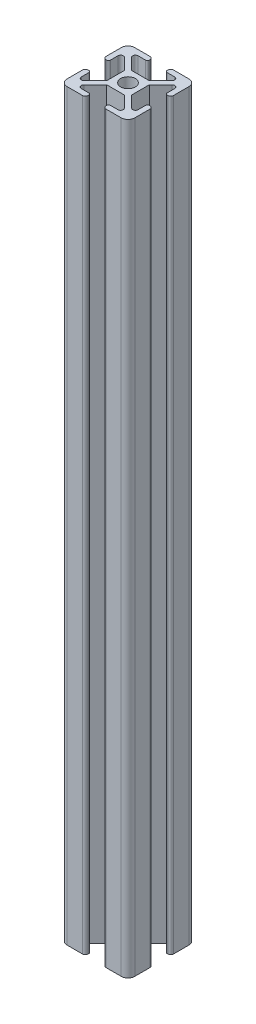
from build123d import *

# Parameters (mm, degrees)
CROQUIS1_R              = 2.175
SALIENTE_EXTRUIR1_DEPTH = 220


with BuildPart() as part:
    # Croquis1 → Saliente-Extruir1 (new body)
    with BuildSketch(Plane(origin=(0, 0, 0), x_dir=(1, 0, 0), z_dir=(0, 1, 0))):
        with BuildLine():
            Line((-2.614339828, 3.675), (2.614339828, 3.675))
            Line((2.614339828, 3.675), (5.973654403, 7.034314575))
            ThreePointArc((5.973654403, 7.034314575), (6.147072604, 7.906146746), (5.407968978, 8.4))
            Line((5.407968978, 8.4), (3.15, 8.4))
            ThreePointArc((3.15, 8.4), (2.796446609, 8.546446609), (2.65, 8.9))
            Line((2.65, 8.9), (2.65, 9.2))
            ThreePointArc((2.65, 9.2), (2.884314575, 9.765685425), (3.45, 10))
            Line((3.45, 10), (8, 10))
            ThreePointArc((8, 10), (9.414213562, 9.414213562), (10, 8))
            Line((10, 8), (10, 3.45))
            ThreePointArc((10, 3.45), (9.765685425, 2.884314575), (9.2, 2.65))
            Line((9.2, 2.65), (8.9, 2.65))
            ThreePointArc((8.9, 2.65), (8.546446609, 2.796446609), (8.4, 3.15))
            Line((8.4, 3.15), (8.4, 5.407968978))
            ThreePointArc((8.4, 5.407968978), (7.906146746, 6.147072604), (7.034314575, 5.973654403))
            Line((7.034314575, 5.973654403), (3.675, 2.614339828))
            Line((3.675, 2.614339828), (3.675, -2.614339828))
            Line((3.675, -2.614339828), (7.034314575, -5.973654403))
            ThreePointArc((7.034314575, -5.973654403), (7.906146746, -6.147072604), (8.4, -5.407968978))
            Line((8.4, -5.407968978), (8.4, -3.15))
            ThreePointArc((8.4, -3.15), (8.546446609, -2.796446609), (8.9, -2.65))
            Line((8.9, -2.65), (9.2, -2.65))
            ThreePointArc((9.2, -2.65), (9.765685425, -2.884314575), (10, -3.45))
            Line((10, -3.45), (10, -8))
            ThreePointArc((10, -8), (9.414213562, -9.414213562), (8, -10))
            Line((8, -10), (3.45, -10))
            ThreePointArc((3.45, -10), (2.884314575, -9.765685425), (2.65, -9.2))
            Line((2.65, -9.2), (2.65, -8.9))
            ThreePointArc((2.65, -8.9), (2.796446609, -8.546446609), (3.15, -8.4))
            Line((3.15, -8.4), (5.407968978, -8.4))
            ThreePointArc((5.407968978, -8.4), (6.147072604, -7.906146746), (5.973654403, -7.034314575))
            Line((5.973654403, -7.034314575), (2.614339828, -3.675))
            Line((2.614339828, -3.675), (-2.614339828, -3.675))
            Line((-2.614339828, -3.675), (-5.973654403, -7.034314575))
            ThreePointArc((-5.973654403, -7.034314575), (-6.147072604, -7.906146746), (-5.407968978, -8.4))
            Line((-5.407968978, -8.4), (-3.15, -8.4))
            ThreePointArc((-3.15, -8.4), (-2.796446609, -8.546446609), (-2.65, -8.9))
            Line((-2.65, -8.9), (-2.65, -9.2))
            ThreePointArc((-2.65, -9.2), (-2.884314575, -9.765685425), (-3.45, -10))
            Line((-3.45, -10), (-8, -10))
            ThreePointArc((-8, -10), (-9.414213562, -9.414213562), (-10, -8))
            Line((-10, -8), (-10, -3.45))
            ThreePointArc((-10, -3.45), (-9.765685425, -2.884314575), (-9.2, -2.65))
            Line((-9.2, -2.65), (-8.9, -2.65))
            ThreePointArc((-8.9, -2.65), (-8.546446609, -2.796446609), (-8.4, -3.15))
            Line((-8.4, -3.15), (-8.4, -5.407968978))
            ThreePointArc((-8.4, -5.407968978), (-7.906146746, -6.147072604), (-7.034314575, -5.973654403))
            Line((-7.034314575, -5.973654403), (-3.675, -2.614339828))
            Line((-3.675, -2.614339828), (-3.675, 2.614339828))
            Line((-3.675, 2.614339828), (-7.034314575, 5.973654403))
            ThreePointArc((-7.034314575, 5.973654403), (-7.906146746, 6.147072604), (-8.4, 5.407968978))
            Line((-8.4, 5.407968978), (-8.4, 3.15))
            ThreePointArc((-8.4, 3.15), (-8.546446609, 2.796446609), (-8.9, 2.65))
            Line((-8.9, 2.65), (-9.2, 2.65))
            ThreePointArc((-9.2, 2.65), (-9.765685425, 2.884314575), (-10, 3.45))
            Line((-10, 3.45), (-10, 8))
            ThreePointArc((-10, 8), (-9.414213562, 9.414213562), (-8, 10))
            Line((-8, 10), (-3.45, 10))
            ThreePointArc((-3.45, 10), (-2.884314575, 9.765685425), (-2.65, 9.2))
            Line((-2.65, 9.2), (-2.65, 8.9))
            ThreePointArc((-2.65, 8.9), (-2.796446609, 8.546446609), (-3.15, 8.4))
            Line((-3.15, 8.4), (-5.407968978, 8.4))
            ThreePointArc((-5.407968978, 8.4), (-6.147072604, 7.906146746), (-5.973654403, 7.034314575))
            Line((-5.973654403, 7.034314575), (-2.614339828, 3.675))
        make_face()
        with Locations(Location((0, 0, 0), (0, 0, 270))):
            Circle(CROQUIS1_R, mode=Mode.SUBTRACT)
    extrude(amount=SALIENTE_EXTRUIR1_DEPTH)


solid = part.part
